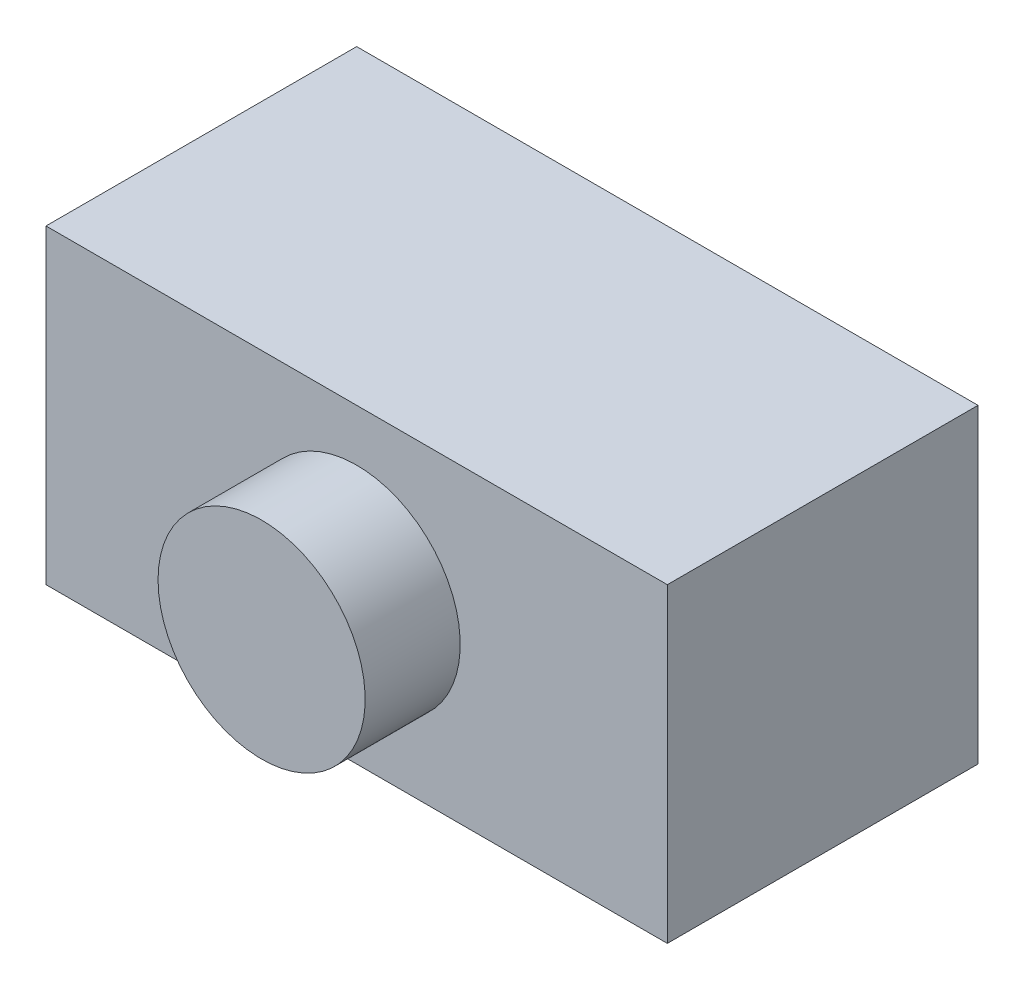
from build123d import *

# Parameters (mm, degrees)
SKETCH1_R           = 12.7
BASE_EXTRUDE_DEPTH  = 5.8293
SKETCH2_W           = 76.2
SKETCH2_H           = 38.1
BOSS_EXTRUDE1_DEPTH = 38.1


with BuildPart() as part:
    # Sketch1 → Base-Extrude (new, symmetric)
    with BuildSketch(Plane.XY):
        with Locations(Location((0, 0, 0), (0, 0, 180))):
            Circle(SKETCH1_R)
    extrude(amount=BASE_EXTRUDE_DEPTH, both=True)

    # Sketch2 → Boss-Extrude1 (add)
    with BuildSketch(Plane(origin=(0, 0, -5.8293), x_dir=(-1, 0, 0), z_dir=(0, 0, -1))):
        Rectangle(SKETCH2_W, SKETCH2_H)
    extrude(amount=BOSS_EXTRUDE1_DEPTH)


solid = part.part
